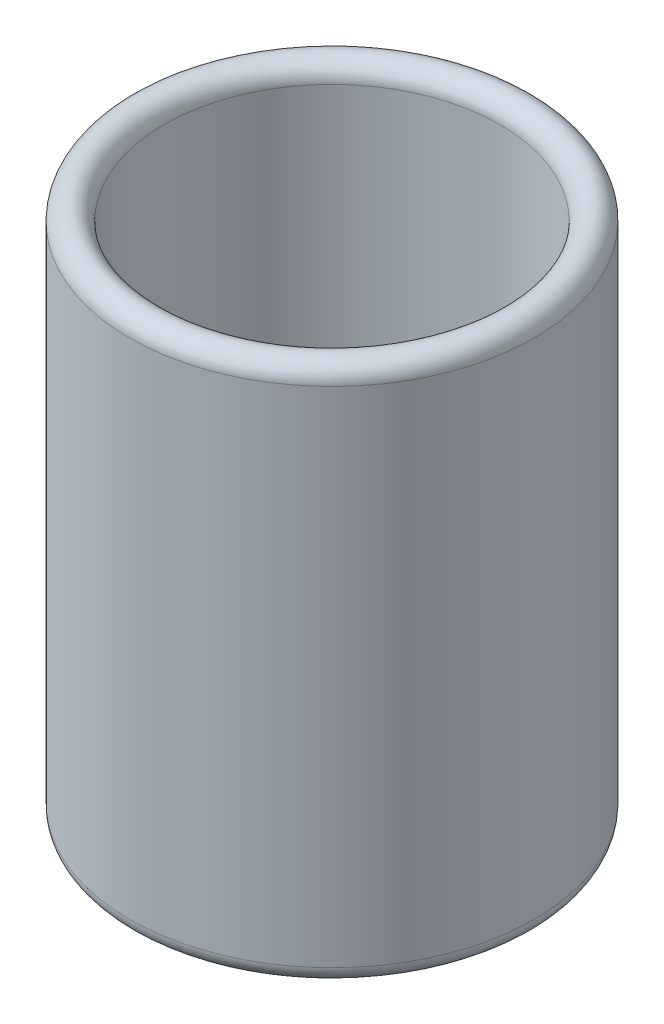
ISO-10303-21;
HEADER;
FILE_DESCRIPTION(('STEP AP214'),'2;1');
FILE_NAME('part.step','',(''),(''),'','','');
FILE_SCHEMA(('AUTOMOTIVE_DESIGN { 1 0 10303 214 1 1 1 1 }'));
ENDSEC;
DATA;
#1=APPLICATION_CONTEXT('core data for automotive mechanical design processes');
#2=APPLICATION_PROTOCOL_DEFINITION('international standard','automotive_design',2000,#1);
#3=PRODUCT_CONTEXT('',#1,'mechanical');
#4=PRODUCT('Part','Part','',(#3));
#5=PRODUCT_RELATED_PRODUCT_CATEGORY('part','',(#4));
#6=PRODUCT_DEFINITION_FORMATION('','',#4);
#7=PRODUCT_DEFINITION_CONTEXT('part definition',#1,'design');
#8=PRODUCT_DEFINITION('design','',#6,#7);
#9=PRODUCT_DEFINITION_SHAPE('','',#8);
#10=(LENGTH_UNIT() NAMED_UNIT(*) SI_UNIT(.MILLI.,.METRE.));
#11=(NAMED_UNIT(*) PLANE_ANGLE_UNIT() SI_UNIT($,.RADIAN.));
#12=(NAMED_UNIT(*) SI_UNIT($,.STERADIAN.) SOLID_ANGLE_UNIT());
#13=UNCERTAINTY_MEASURE_WITH_UNIT(LENGTH_MEASURE(1.E-05),#10,'distance_accuracy_value','');
#14=(GEOMETRIC_REPRESENTATION_CONTEXT(3) GLOBAL_UNCERTAINTY_ASSIGNED_CONTEXT((#13)) GLOBAL_UNIT_ASSIGNED_CONTEXT((#10,
#11,#12)) REPRESENTATION_CONTEXT('',''));
#15=CARTESIAN_POINT('',(0.,0.,0.));
#16=DIRECTION('',(0.,0.,1.));
#17=DIRECTION('',(1.,0.,0.));
#18=AXIS2_PLACEMENT_3D('',#15,#16,#17);
#19=CARTESIAN_POINT('',(0.,0.1016,0.));
#20=DIRECTION('',(0.,1.,0.));
#21=DIRECTION('',(0.,0.,1.));
#22=AXIS2_PLACEMENT_3D('',#19,#20,#21);
#23=TOROIDAL_SURFACE('',#22,1.0922,0.1016);
#24=CARTESIAN_POINT('',(0.,0.1016,0.));
#25=DIRECTION('',(0.,1.,0.));
#26=DIRECTION('',(0.,0.,1.));
#27=AXIS2_PLACEMENT_3D('',#24,#25,#26);
#28=CIRCLE('',#27,0.9906);
#29=CARTESIAN_POINT('',(0.,0.1016,0.9906));
#30=VERTEX_POINT('',#29);
#31=EDGE_CURVE('E41',#30,#30,#28,.F.);
#32=ORIENTED_EDGE('',*,*,#31,.F.);
#33=EDGE_LOOP('',(#32));
#34=FACE_BOUND('',#33,.T.);
#35=CARTESIAN_POINT('',(0.,0.1016,0.));
#36=DIRECTION('',(0.,1.,0.));
#37=DIRECTION('',(0.,0.,1.));
#38=AXIS2_PLACEMENT_3D('',#35,#36,#37);
#39=CIRCLE('',#38,1.1938);
#40=CARTESIAN_POINT('',(0.,0.1016,1.1938));
#41=VERTEX_POINT('',#40);
#42=EDGE_CURVE('E10',#41,#41,#39,.T.);
#43=ORIENTED_EDGE('',*,*,#42,.F.);
#44=EDGE_LOOP('',(#43));
#45=FACE_BOUND('',#44,.T.);
#46=ADVANCED_FACE('F34',(#34,#45),#23,.T.);
#47=CARTESIAN_POINT('',(0.,3.0734,0.));
#48=DIRECTION('',(0.,1.,0.));
#49=DIRECTION('',(0.,0.,1.));
#50=AXIS2_PLACEMENT_3D('',#47,#48,#49);
#51=TOROIDAL_SURFACE('',#50,1.0922,0.1016);
#52=CARTESIAN_POINT('',(0.,3.0734,0.));
#53=DIRECTION('',(0.,1.,0.));
#54=DIRECTION('',(0.,0.,1.));
#55=AXIS2_PLACEMENT_3D('',#52,#53,#54);
#56=CIRCLE('',#55,1.1938);
#57=CARTESIAN_POINT('',(0.,3.0734,1.1938));
#58=VERTEX_POINT('',#57);
#59=EDGE_CURVE('E49',#58,#58,#56,.F.);
#60=ORIENTED_EDGE('',*,*,#59,.F.);
#61=EDGE_LOOP('',(#60));
#62=FACE_BOUND('',#61,.T.);
#63=CARTESIAN_POINT('',(0.,3.0734,0.));
#64=DIRECTION('',(0.,1.,0.));
#65=DIRECTION('',(0.,0.,1.));
#66=AXIS2_PLACEMENT_3D('',#63,#64,#65);
#67=CIRCLE('',#66,0.9906);
#68=CARTESIAN_POINT('',(0.,3.0734,0.9906));
#69=VERTEX_POINT('',#68);
#70=EDGE_CURVE('E45',#69,#69,#67,.T.);
#71=ORIENTED_EDGE('',*,*,#70,.F.);
#72=EDGE_LOOP('',(#71));
#73=FACE_BOUND('',#72,.T.);
#74=ADVANCED_FACE('F57',(#62,#73),#51,.T.);
#75=CARTESIAN_POINT('',(0.,3.175,0.));
#76=DIRECTION('',(0.,-1.,0.));
#77=DIRECTION('',(0.,0.,-1.));
#78=AXIS2_PLACEMENT_3D('',#75,#76,#77);
#79=CYLINDRICAL_SURFACE('',#78,1.1938);
#80=ORIENTED_EDGE('',*,*,#42,.T.);
#81=EDGE_LOOP('',(#80));
#82=FACE_BOUND('',#81,.T.);
#83=ORIENTED_EDGE('',*,*,#59,.T.);
#84=EDGE_LOOP('',(#83));
#85=FACE_BOUND('',#84,.T.);
#86=ADVANCED_FACE('F55',(#82,#85),#79,.T.);
#87=CARTESIAN_POINT('',(0.,3.175,0.));
#88=DIRECTION('',(0.,-1.,0.));
#89=DIRECTION('',(0.,0.,-1.));
#90=AXIS2_PLACEMENT_3D('',#87,#88,#89);
#91=CYLINDRICAL_SURFACE('',#90,0.9906);
#92=ORIENTED_EDGE('',*,*,#31,.T.);
#93=EDGE_LOOP('',(#92));
#94=FACE_BOUND('',#93,.T.);
#95=ORIENTED_EDGE('',*,*,#70,.T.);
#96=EDGE_LOOP('',(#95));
#97=FACE_BOUND('',#96,.T.);
#98=ADVANCED_FACE('F62',(#94,#97),#91,.F.);
#99=CLOSED_SHELL('',(#46,#74,#86,#98));
#100=MANIFOLD_SOLID_BREP('B2',#99);
#101=ADVANCED_BREP_SHAPE_REPRESENTATION('',(#18,#100),#14);
#102=SHAPE_DEFINITION_REPRESENTATION(#9,#101);
ENDSEC;
END-ISO-10303-21;
